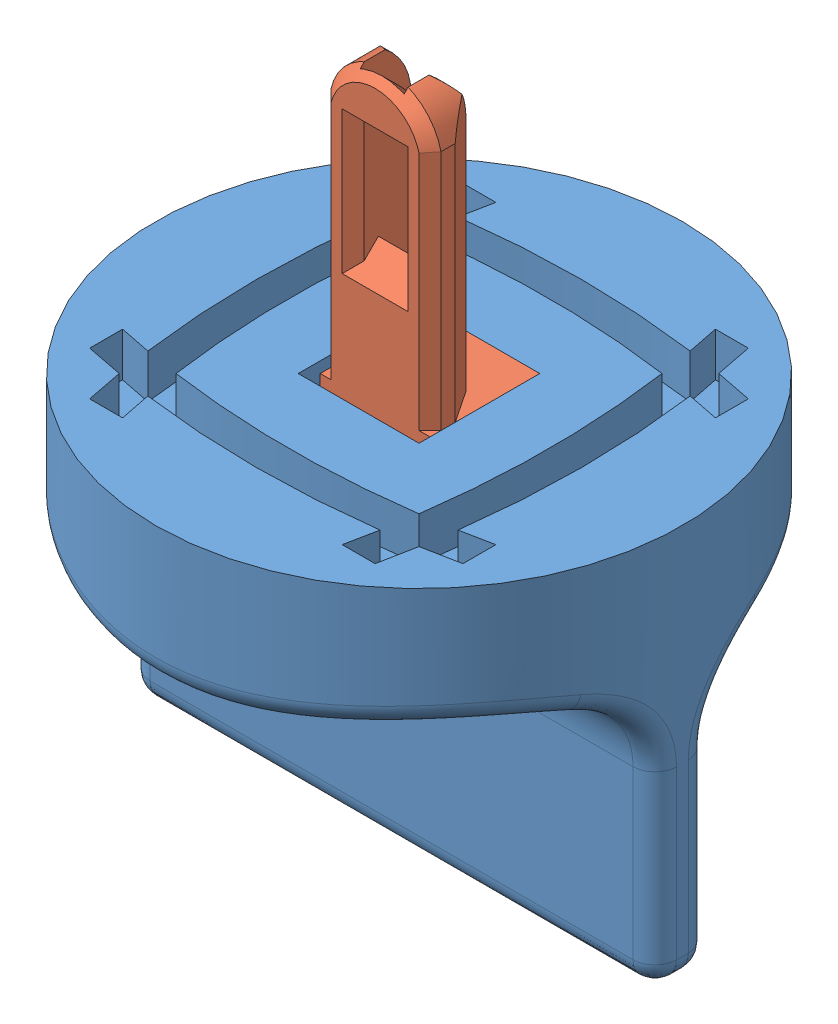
SolidWorks assembly Assem6.sldasm, configuration Default (file format 8000). Lengths in mm.
Overall size (48 61.65 48).
2 component instances, 2 part files, 2 mates.
Components (placement in the parent):
- pinch-1: pinch.SLDPRT [Default] at (17.58 25.9912 36.3819) size (48 36 48)
- connector_falcon-1: connector_falcon.SLDPRT [Default] at (23.08 55.9912 40.8819) x (0 -1 0) z (1 0 0) size (30.65 10 10)
Mates (geometry in assembly coordinates):
- Coincident1: coincident: line of pinch-1 through (23.08 33.9912 30.8819) axis (-1 0 0); line of connector_falcon-1 through (13.08 33.9912 30.8819) axis (1 0 0)
- Coincident2: coincident anti-aligned: line of pinch-1 through (23.08 33.9912 41.8819) axis (0 0 -1); line of connector_falcon-1 through (23.08 33.9912 30.8819) axis (0 0 1)
